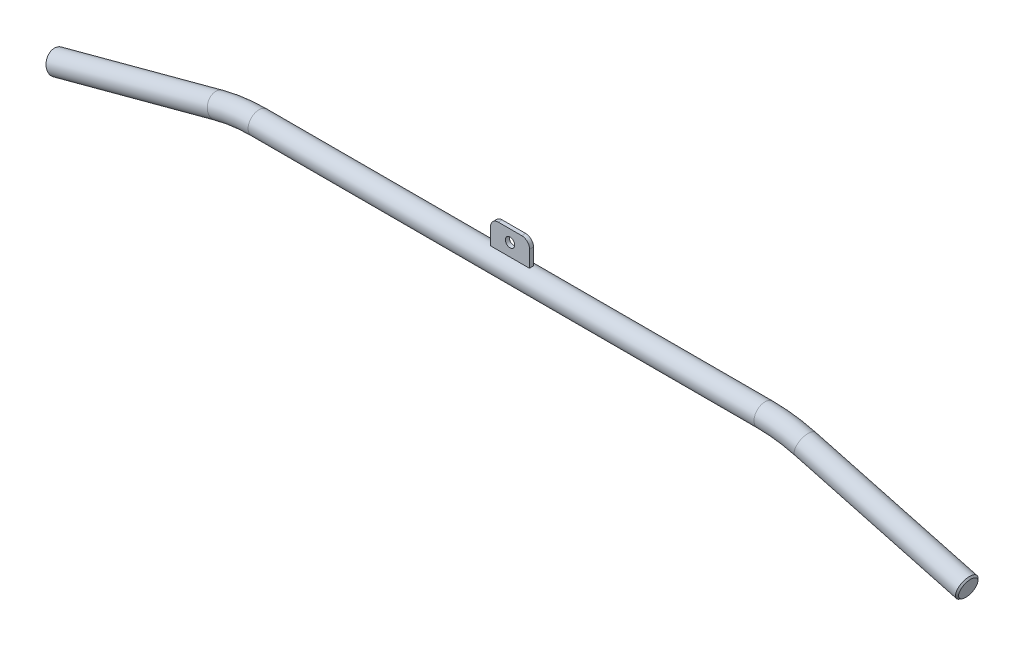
ISO-10303-21;
HEADER;
FILE_DESCRIPTION(('STEP AP214'),'2;1');
FILE_NAME('part.step','',(''),(''),'','','');
FILE_SCHEMA(('AUTOMOTIVE_DESIGN { 1 0 10303 214 1 1 1 1 }'));
ENDSEC;
DATA;
#1=APPLICATION_CONTEXT('core data for automotive mechanical design processes');
#2=APPLICATION_PROTOCOL_DEFINITION('international standard','automotive_design',2000,#1);
#3=PRODUCT_CONTEXT('',#1,'mechanical');
#4=PRODUCT('Part','Part','',(#3));
#5=PRODUCT_RELATED_PRODUCT_CATEGORY('part','',(#4));
#6=PRODUCT_DEFINITION_FORMATION('','',#4);
#7=PRODUCT_DEFINITION_CONTEXT('part definition',#1,'design');
#8=PRODUCT_DEFINITION('design','',#6,#7);
#9=PRODUCT_DEFINITION_SHAPE('','',#8);
#10=(LENGTH_UNIT() NAMED_UNIT(*) SI_UNIT(.MILLI.,.METRE.));
#11=(NAMED_UNIT(*) PLANE_ANGLE_UNIT() SI_UNIT($,.RADIAN.));
#12=(NAMED_UNIT(*) SI_UNIT($,.STERADIAN.) SOLID_ANGLE_UNIT());
#13=UNCERTAINTY_MEASURE_WITH_UNIT(LENGTH_MEASURE(1.E-05),#10,'distance_accuracy_value','');
#14=(GEOMETRIC_REPRESENTATION_CONTEXT(3) GLOBAL_UNCERTAINTY_ASSIGNED_CONTEXT((#13)) GLOBAL_UNIT_ASSIGNED_CONTEXT((#10,
#11,#12)) REPRESENTATION_CONTEXT('',''));
#15=CARTESIAN_POINT('',(0.,0.,0.));
#16=DIRECTION('',(0.,0.,1.));
#17=DIRECTION('',(1.,0.,0.));
#18=AXIS2_PLACEMENT_3D('',#15,#16,#17);
#19=CARTESIAN_POINT('',(-323.669500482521,0.,0.));
#20=DIRECTION('',(1.,0.,0.));
#21=DIRECTION('',(0.,1.,0.));
#22=AXIS2_PLACEMENT_3D('',#19,#20,#21);
#23=CYLINDRICAL_SURFACE('',#22,14.);
#24=CARTESIAN_POINT('',(323.66950048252,0.,0.));
#25=DIRECTION('',(-1.,0.,0.));
#26=DIRECTION('',(0.,-1.,0.));
#27=AXIS2_PLACEMENT_3D('',#24,#25,#26);
#28=CIRCLE('',#27,14.);
#29=CARTESIAN_POINT('',(323.66950048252,14.,0.));
#30=VERTEX_POINT('',#29);
#31=EDGE_CURVE('E136',#30,#30,#28,.T.);
#32=ORIENTED_EDGE('',*,*,#31,.T.);
#33=EDGE_LOOP('',(#32));
#34=FACE_BOUND('',#33,.T.);
#35=CARTESIAN_POINT('',(-323.669500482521,0.,0.));
#36=DIRECTION('',(-1.,0.,0.));
#37=DIRECTION('',(0.,-1.,0.));
#38=AXIS2_PLACEMENT_3D('',#35,#36,#37);
#39=CIRCLE('',#38,14.);
#40=CARTESIAN_POINT('',(-323.669500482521,14.,0.));
#41=VERTEX_POINT('',#40);
#42=EDGE_CURVE('E133',#41,#41,#39,.T.);
#43=ORIENTED_EDGE('',*,*,#42,.F.);
#44=EDGE_LOOP('',(#43));
#45=FACE_BOUND('',#44,.T.);
#46=DIRECTION('',(1.,0.,0.));
#47=VECTOR('',#46,1.);
#48=CARTESIAN_POINT('',(-323.669500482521,13.7749773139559,-2.5));
#49=LINE('',#48,#47);
#50=CARTESIAN_POINT('',(25.,13.7749773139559,-2.5));
#51=VERTEX_POINT('',#50);
#52=CARTESIAN_POINT('',(-25.,13.7749773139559,-2.5));
#53=VERTEX_POINT('',#52);
#54=EDGE_CURVE('E11',#51,#53,#49,.F.);
#55=ORIENTED_EDGE('',*,*,#54,.F.);
#56=CARTESIAN_POINT('',(25.,0.,0.));
#57=DIRECTION('',(1.,0.,0.));
#58=DIRECTION('',(0.,1.,0.));
#59=AXIS2_PLACEMENT_3D('',#56,#57,#58);
#60=CIRCLE('',#59,14.);
#61=CARTESIAN_POINT('',(25.,13.7749773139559,2.5));
#62=VERTEX_POINT('',#61);
#63=EDGE_CURVE('E54',#51,#62,#60,.T.);
#64=ORIENTED_EDGE('',*,*,#63,.T.);
#65=DIRECTION('',(1.,0.,0.));
#66=VECTOR('',#65,1.);
#67=CARTESIAN_POINT('',(-323.669500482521,13.7749773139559,2.5));
#68=LINE('',#67,#66);
#69=CARTESIAN_POINT('',(-25.,13.7749773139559,2.5));
#70=VERTEX_POINT('',#69);
#71=EDGE_CURVE('E91',#62,#70,#68,.F.);
#72=ORIENTED_EDGE('',*,*,#71,.T.);
#73=CARTESIAN_POINT('',(-25.,0.,0.));
#74=DIRECTION('',(-1.,0.,0.));
#75=DIRECTION('',(0.,-1.,0.));
#76=AXIS2_PLACEMENT_3D('',#73,#74,#75);
#77=CIRCLE('',#76,14.);
#78=EDGE_CURVE('E39',#70,#53,#77,.T.);
#79=ORIENTED_EDGE('',*,*,#78,.T.);
#80=EDGE_LOOP('',(#55,#64,#72,#79));
#81=FACE_BOUND('',#80,.T.);
#82=ADVANCED_FACE('F31',(#34,#45,#81),#23,.T.);
#83=CARTESIAN_POINT('',(375.433309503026,-6.81483474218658,0.));
#84=DIRECTION('',(0.965925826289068,-0.258819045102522,0.));
#85=DIRECTION('',(0.258819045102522,0.965925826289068,0.));
#86=AXIS2_PLACEMENT_3D('',#83,#84,#85);
#87=CYLINDRICAL_SURFACE('',#86,14.);
#88=CARTESIAN_POINT('',(581.822198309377,-62.1165708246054,0.));
#89=DIRECTION('',(-0.965925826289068,0.258819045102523,0.));
#90=DIRECTION('',(-0.258819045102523,-0.965925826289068,0.));
#91=AXIS2_PLACEMENT_3D('',#88,#89,#90);
#92=CIRCLE('',#91,14.);
#93=CARTESIAN_POINT('',(578.198731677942,-75.6395323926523,0.));
#94=VERTEX_POINT('',#93);
#95=EDGE_CURVE('E142',#94,#94,#92,.T.);
#96=ORIENTED_EDGE('',*,*,#95,.T.);
#97=EDGE_LOOP('',(#96));
#98=FACE_BOUND('',#97,.T.);
#99=CARTESIAN_POINT('',(375.433309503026,-6.81483474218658,0.));
#100=DIRECTION('',(-0.965925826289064,0.258819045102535,0.));
#101=DIRECTION('',(-0.258819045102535,-0.965925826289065,0.));
#102=AXIS2_PLACEMENT_3D('',#99,#100,#101);
#103=CIRCLE('',#102,14.);
#104=CARTESIAN_POINT('',(379.056776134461,6.70812682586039,0.));
#105=VERTEX_POINT('',#104);
#106=EDGE_CURVE('E139',#105,#105,#103,.T.);
#107=ORIENTED_EDGE('',*,*,#106,.F.);
#108=EDGE_LOOP('',(#107));
#109=FACE_BOUND('',#108,.T.);
#110=ADVANCED_FACE('F180',(#98,#109),#87,.T.);
#111=CARTESIAN_POINT('',(323.669500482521,-200.,0.));
#112=DIRECTION('',(0.,0.,-1.));
#113=DIRECTION('',(-1.,0.,0.));
#114=AXIS2_PLACEMENT_3D('',#111,#112,#113);
#115=TOROIDAL_SURFACE('',#114,200.,14.);
#116=CARTESIAN_POINT('',(323.669500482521,-200.,0.));
#117=DIRECTION('',(0.,0.,-1.));
#118=DIRECTION('',(-1.,0.,0.));
#119=AXIS2_PLACEMENT_3D('',#116,#117,#118);
#120=CIRCLE('',#119,214.);
#121=EDGE_CURVE('',#30,#105,#120,.T.);
#122=ORIENTED_EDGE('',*,*,#31,.F.);
#123=ORIENTED_EDGE('',*,*,#106,.T.);
#124=ORIENTED_EDGE('',*,*,#121,.T.);
#125=ORIENTED_EDGE('',*,*,#121,.F.);
#126=EDGE_LOOP('',(#122,#124,#123,#125));
#127=FACE_BOUND('',#126,.T.);
#128=ADVANCED_FACE('F186',(#127),#115,.T.);
#129=CARTESIAN_POINT('',(-323.669500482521,-200.,0.));
#130=DIRECTION('',(0.,0.,-1.));
#131=DIRECTION('',(-1.,0.,0.));
#132=AXIS2_PLACEMENT_3D('',#129,#130,#131);
#133=TOROIDAL_SURFACE('',#132,200.,14.);
#134=CARTESIAN_POINT('',(-375.433309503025,-6.81483474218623,0.));
#135=DIRECTION('',(-0.96592582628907,-0.258819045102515,0.));
#136=DIRECTION('',(0.258819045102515,-0.96592582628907,0.));
#137=AXIS2_PLACEMENT_3D('',#134,#135,#136);
#138=CIRCLE('',#137,14.);
#139=CARTESIAN_POINT('',(-379.056776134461,6.70812682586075,0.));
#140=VERTEX_POINT('',#139);
#141=EDGE_CURVE('E127',#140,#140,#138,.T.);
#142=CARTESIAN_POINT('',(-323.669500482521,-200.,0.));
#143=DIRECTION('',(0.,0.,-1.));
#144=DIRECTION('',(-1.,0.,0.));
#145=AXIS2_PLACEMENT_3D('',#142,#143,#144);
#146=CIRCLE('',#145,214.);
#147=EDGE_CURVE('',#140,#41,#146,.T.);
#148=ORIENTED_EDGE('',*,*,#141,.F.);
#149=ORIENTED_EDGE('',*,*,#42,.T.);
#150=ORIENTED_EDGE('',*,*,#147,.T.);
#151=ORIENTED_EDGE('',*,*,#147,.F.);
#152=EDGE_LOOP('',(#148,#150,#149,#151));
#153=FACE_BOUND('',#152,.T.);
#154=ADVANCED_FACE('F192',(#153),#133,.T.);
#155=CARTESIAN_POINT('',(-375.433309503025,-6.81483474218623,0.));
#156=DIRECTION('',(-0.96592582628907,-0.258819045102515,0.));
#157=DIRECTION('',(0.258819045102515,-0.96592582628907,0.));
#158=AXIS2_PLACEMENT_3D('',#155,#156,#157);
#159=CYLINDRICAL_SURFACE('',#158,14.);
#160=CARTESIAN_POINT('',(-581.822198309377,-62.1165708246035,0.));
#161=DIRECTION('',(-0.965925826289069,-0.258819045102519,0.));
#162=DIRECTION('',(0.258819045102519,-0.965925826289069,0.));
#163=AXIS2_PLACEMENT_3D('',#160,#161,#162);
#164=CIRCLE('',#163,14.);
#165=CARTESIAN_POINT('',(-585.445664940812,-48.5936092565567,0.));
#166=VERTEX_POINT('',#165);
#167=EDGE_CURVE('E151',#166,#166,#164,.F.);
#168=ORIENTED_EDGE('',*,*,#167,.T.);
#169=EDGE_LOOP('',(#168));
#170=FACE_BOUND('',#169,.T.);
#171=ORIENTED_EDGE('',*,*,#141,.T.);
#172=EDGE_LOOP('',(#171));
#173=FACE_BOUND('',#172,.T.);
#174=ADVANCED_FACE('F216',(#170,#173),#159,.T.);
#175=CARTESIAN_POINT('',(583.754049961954,-62.6342089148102,0.));
#176=DIRECTION('',(-0.965925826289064,0.258819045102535,0.));
#177=DIRECTION('',(-0.258819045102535,-0.965925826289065,0.));
#178=AXIS2_PLACEMENT_3D('',#175,#176,#177);
#179=PLANE('',#178);
#180=CARTESIAN_POINT('',(583.754049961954,-62.6342089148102,0.));
#181=DIRECTION('',(-0.965925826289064,0.258819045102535,0.));
#182=DIRECTION('',(-0.258819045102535,-0.965925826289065,0.));
#183=AXIS2_PLACEMENT_3D('',#180,#181,#182);
#184=CIRCLE('',#183,12.000000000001);
#185=CARTESIAN_POINT('',(580.648221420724,-74.22531883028,0.));
#186=VERTEX_POINT('',#185);
#187=EDGE_CURVE('E145',#186,#186,#184,.F.);
#188=ORIENTED_EDGE('',*,*,#187,.T.);
#189=EDGE_LOOP('',(#188));
#190=FACE_BOUND('',#189,.T.);
#191=ADVANCED_FACE('F205',(#190),#179,.F.);
#192=CARTESIAN_POINT('',(-583.754049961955,-62.6342089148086,0.));
#193=DIRECTION('',(-0.96592582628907,-0.258819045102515,0.));
#194=DIRECTION('',(0.258819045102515,-0.96592582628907,0.));
#195=AXIS2_PLACEMENT_3D('',#192,#193,#194);
#196=PLANE('',#195);
#197=CARTESIAN_POINT('',(-583.754049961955,-62.6342089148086,0.));
#198=DIRECTION('',(-0.96592582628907,-0.258819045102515,0.));
#199=DIRECTION('',(0.258819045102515,-0.96592582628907,0.));
#200=AXIS2_PLACEMENT_3D('',#197,#198,#199);
#201=CIRCLE('',#200,12.0000000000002);
#202=CARTESIAN_POINT('',(-586.859878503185,-51.0430989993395,0.));
#203=VERTEX_POINT('',#202);
#204=EDGE_CURVE('E148',#203,#203,#201,.T.);
#205=ORIENTED_EDGE('',*,*,#204,.T.);
#206=EDGE_LOOP('',(#205));
#207=FACE_BOUND('',#206,.T.);
#208=ADVANCED_FACE('F198',(#207),#196,.T.);
#209=CARTESIAN_POINT('',(581.822198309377,-62.1165708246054,0.));
#210=DIRECTION('',(-0.965925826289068,0.258819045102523,0.));
#211=DIRECTION('',(-0.258819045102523,-0.965925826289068,0.));
#212=AXIS2_PLACEMENT_3D('',#209,#210,#211);
#213=CONICAL_SURFACE('',#212,14.,0.785398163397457);
#214=CARTESIAN_POINT('',(580.648221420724,-74.22531883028,0.));
#215=CARTESIAN_POINT('',(580.62270590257,-74.2400502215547,0.));
#216=CARTESIAN_POINT('',(580.597190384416,-74.2547816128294,0.));
#217=CARTESIAN_POINT('',(580.546159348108,-74.2842443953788,0.));
#218=CARTESIAN_POINT('',(580.520643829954,-74.2989757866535,0.));
#219=CARTESIAN_POINT('',(580.469612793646,-74.328438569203,0.));
#220=CARTESIAN_POINT('',(580.444097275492,-74.3431699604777,0.));
#221=CARTESIAN_POINT('',(580.393066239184,-74.3726327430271,0.));
#222=CARTESIAN_POINT('',(580.36755072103,-74.3873641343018,0.));
#223=CARTESIAN_POINT('',(580.316519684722,-74.4168269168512,0.));
#224=CARTESIAN_POINT('',(580.291004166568,-74.4315583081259,0.));
#225=CARTESIAN_POINT('',(580.23997313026,-74.4610210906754,0.));
#226=CARTESIAN_POINT('',(580.214457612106,-74.4757524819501,0.));
#227=CARTESIAN_POINT('',(580.163426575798,-74.5052152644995,0.));
#228=CARTESIAN_POINT('',(580.137911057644,-74.5199466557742,0.));
#229=CARTESIAN_POINT('',(580.086880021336,-74.5494094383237,0.));
#230=CARTESIAN_POINT('',(580.061364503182,-74.5641408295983,0.));
#231=CARTESIAN_POINT('',(580.010333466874,-74.5936036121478,0.));
#232=CARTESIAN_POINT('',(579.98481794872,-74.6083350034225,0.));
#233=CARTESIAN_POINT('',(579.933786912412,-74.6377977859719,0.));
#234=CARTESIAN_POINT('',(579.908271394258,-74.6525291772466,0.));
#235=CARTESIAN_POINT('',(579.85724035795,-74.6819919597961,0.));
#236=CARTESIAN_POINT('',(579.831724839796,-74.6967233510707,0.));
#237=CARTESIAN_POINT('',(579.780693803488,-74.7261861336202,0.));
#238=CARTESIAN_POINT('',(579.755178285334,-74.7409175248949,0.));
#239=CARTESIAN_POINT('',(579.704147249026,-74.7703803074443,0.));
#240=CARTESIAN_POINT('',(579.678631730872,-74.785111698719,0.));
#241=CARTESIAN_POINT('',(579.627600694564,-74.8145744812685,0.));
#242=CARTESIAN_POINT('',(579.602085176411,-74.8293058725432,0.));
#243=CARTESIAN_POINT('',(579.551054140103,-74.8587686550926,0.));
#244=CARTESIAN_POINT('',(579.525538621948,-74.8735000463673,0.));
#245=CARTESIAN_POINT('',(579.474507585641,-74.9029628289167,0.));
#246=CARTESIAN_POINT('',(579.448992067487,-74.9176942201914,0.));
#247=CARTESIAN_POINT('',(579.397961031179,-74.9471570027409,0.));
#248=CARTESIAN_POINT('',(579.372445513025,-74.9618883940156,0.));
#249=CARTESIAN_POINT('',(579.321414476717,-74.991351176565,0.));
#250=CARTESIAN_POINT('',(579.295898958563,-75.0060825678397,0.));
#251=CARTESIAN_POINT('',(579.244867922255,-75.0355453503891,0.));
#252=CARTESIAN_POINT('',(579.219352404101,-75.0502767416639,0.));
#253=CARTESIAN_POINT('',(579.168321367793,-75.0797395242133,0.));
#254=CARTESIAN_POINT('',(579.142805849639,-75.094470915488,0.));
#255=CARTESIAN_POINT('',(579.091774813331,-75.1239336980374,0.));
#256=CARTESIAN_POINT('',(579.066259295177,-75.1386650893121,0.));
#257=CARTESIAN_POINT('',(579.015228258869,-75.1681278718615,0.));
#258=CARTESIAN_POINT('',(578.989712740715,-75.1828592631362,0.));
#259=CARTESIAN_POINT('',(578.938681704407,-75.2123220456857,0.));
#260=CARTESIAN_POINT('',(578.913166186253,-75.2270534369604,0.));
#261=CARTESIAN_POINT('',(578.862135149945,-75.2565162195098,0.));
#262=CARTESIAN_POINT('',(578.836619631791,-75.2712476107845,0.));
#263=CARTESIAN_POINT('',(578.785588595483,-75.3007103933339,0.));
#264=CARTESIAN_POINT('',(578.760073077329,-75.3154417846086,0.));
#265=CARTESIAN_POINT('',(578.709042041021,-75.3449045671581,0.));
#266=CARTESIAN_POINT('',(578.683526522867,-75.3596359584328,0.));
#267=CARTESIAN_POINT('',(578.632495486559,-75.3890987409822,0.));
#268=CARTESIAN_POINT('',(578.606979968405,-75.4038301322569,0.));
#269=CARTESIAN_POINT('',(578.555948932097,-75.4332929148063,0.));
#270=CARTESIAN_POINT('',(578.530433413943,-75.4480243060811,0.));
#271=CARTESIAN_POINT('',(578.479402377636,-75.4774870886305,0.));
#272=CARTESIAN_POINT('',(578.453886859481,-75.4922184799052,0.));
#273=CARTESIAN_POINT('',(578.402855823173,-75.5216812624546,0.));
#274=CARTESIAN_POINT('',(578.37734030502,-75.5364126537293,0.));
#275=CARTESIAN_POINT('',(578.326309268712,-75.5658754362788,0.));
#276=CARTESIAN_POINT('',(578.300793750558,-75.5806068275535,0.));
#277=CARTESIAN_POINT('',(578.24976271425,-75.6100696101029,0.));
#278=CARTESIAN_POINT('',(578.224247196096,-75.6248010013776,0.));
#279=CARTESIAN_POINT('',(578.198731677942,-75.6395323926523,0.));
#280=B_SPLINE_CURVE_WITH_KNOTS('',3,(#214,#215,#216,#217,#218,#219,#220,#221,#222,#223,#224,
#225,#226,#227,#228,#229,#230,#231,#232,#233,#234,#235,#236,#237,#238,#239,#240,#241,#242,#243,
#244,#245,#246,#247,#248,#249,#250,#251,#252,#253,#254,#255,#256,#257,#258,#259,#260,#261,#262,
#263,#264,#265,#266,#267,#268,#269,#270,#271,#272,#273,#274,#275,#276,#277,#278,#279),
.UNSPECIFIED.,.F.,.F.,(4,2,2,2,2,2,2,2,2,2,2,2,2,2,2,2,2,2,2,2,2,2,2,2,2,2,2,2,2,2,2,2,4),(0.,
0.0883883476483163,0.176776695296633,0.265165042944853,0.353553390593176,0.441941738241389,
0.530330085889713,0.618718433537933,0.707106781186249,0.795495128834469,0.883883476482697,
0.972271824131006,1.06066017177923,1.14904851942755,1.23743686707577,1.32582521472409,
1.41421356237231,1.50260191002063,1.59099025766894,1.67937860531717,1.76776695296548,
1.8561553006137,1.94454364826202,2.03293199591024,2.12132034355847,2.20970869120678,
2.298097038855,2.38648538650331,2.47487373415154,2.56326208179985,2.65165042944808,
2.7400387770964,2.82842712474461),.UNSPECIFIED.);
#281=EDGE_CURVE('BSEAM196',#186,#94,#280,.T.);
#282=ORIENTED_EDGE('',*,*,#187,.F.);
#283=ORIENTED_EDGE('',*,*,#95,.F.);
#284=ORIENTED_EDGE('',*,*,#281,.T.);
#285=ORIENTED_EDGE('',*,*,#281,.F.);
#286=EDGE_LOOP('',(#282,#284,#283,#285));
#287=FACE_BOUND('',#286,.T.);
#288=ADVANCED_FACE('F196',(#287),#213,.T.);
#289=CARTESIAN_POINT('',(-583.754049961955,-62.6342089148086,0.));
#290=DIRECTION('',(0.965925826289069,0.258819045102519,0.));
#291=DIRECTION('',(-0.258819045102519,0.965925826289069,0.));
#292=AXIS2_PLACEMENT_3D('',#289,#290,#291);
#293=CONICAL_SURFACE('',#292,12.0000000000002,0.785398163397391);
#294=CARTESIAN_POINT('',(-585.445664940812,-48.5936092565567,0.));
#295=CARTESIAN_POINT('',(-585.460396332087,-48.6191247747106,0.));
#296=CARTESIAN_POINT('',(-585.475127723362,-48.6446402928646,0.));
#297=CARTESIAN_POINT('',(-585.504590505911,-48.6956713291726,0.));
#298=CARTESIAN_POINT('',(-585.519321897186,-48.7211868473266,0.));
#299=CARTESIAN_POINT('',(-585.548784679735,-48.7722178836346,0.));
#300=CARTESIAN_POINT('',(-585.56351607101,-48.7977334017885,0.));
#301=CARTESIAN_POINT('',(-585.592978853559,-48.8487644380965,0.));
#302=CARTESIAN_POINT('',(-585.607710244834,-48.8742799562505,0.));
#303=CARTESIAN_POINT('',(-585.637173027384,-48.9253109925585,0.));
#304=CARTESIAN_POINT('',(-585.651904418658,-48.9508265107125,0.));
#305=CARTESIAN_POINT('',(-585.681367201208,-49.0018575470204,0.));
#306=CARTESIAN_POINT('',(-585.696098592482,-49.0273730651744,0.));
#307=CARTESIAN_POINT('',(-585.725561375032,-49.0784041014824,0.));
#308=CARTESIAN_POINT('',(-585.740292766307,-49.1039196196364,0.));
#309=CARTESIAN_POINT('',(-585.769755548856,-49.1549506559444,0.));
#310=CARTESIAN_POINT('',(-585.784486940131,-49.1804661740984,0.));
#311=CARTESIAN_POINT('',(-585.81394972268,-49.2314972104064,0.));
#312=CARTESIAN_POINT('',(-585.828681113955,-49.2570127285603,0.));
#313=CARTESIAN_POINT('',(-585.858143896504,-49.3080437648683,0.));
#314=CARTESIAN_POINT('',(-585.872875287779,-49.3335592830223,0.));
#315=CARTESIAN_POINT('',(-585.902338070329,-49.3845903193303,0.));
#316=CARTESIAN_POINT('',(-585.917069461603,-49.4101058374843,0.));
#317=CARTESIAN_POINT('',(-585.946532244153,-49.4611368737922,0.));
#318=CARTESIAN_POINT('',(-585.961263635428,-49.4866523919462,0.));
#319=CARTESIAN_POINT('',(-585.990726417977,-49.5376834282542,0.));
#320=CARTESIAN_POINT('',(-586.005457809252,-49.5631989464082,0.));
#321=CARTESIAN_POINT('',(-586.034920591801,-49.6142299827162,0.));
#322=CARTESIAN_POINT('',(-586.049651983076,-49.6397455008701,0.));
#323=CARTESIAN_POINT('',(-586.079114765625,-49.6907765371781,0.));
#324=CARTESIAN_POINT('',(-586.0938461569,-49.7162920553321,0.));
#325=CARTESIAN_POINT('',(-586.123308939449,-49.7673230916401,0.));
#326=CARTESIAN_POINT('',(-586.138040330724,-49.7928386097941,0.));
#327=CARTESIAN_POINT('',(-586.167503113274,-49.843869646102,0.));
#328=CARTESIAN_POINT('',(-586.182234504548,-49.869385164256,0.));
#329=CARTESIAN_POINT('',(-586.211697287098,-49.920416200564,0.));
#330=CARTESIAN_POINT('',(-586.226428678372,-49.945931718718,0.));
#331=CARTESIAN_POINT('',(-586.255891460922,-49.996962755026,0.));
#332=CARTESIAN_POINT('',(-586.270622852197,-50.02247827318,0.));
#333=CARTESIAN_POINT('',(-586.300085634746,-50.0735093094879,0.));
#334=CARTESIAN_POINT('',(-586.314817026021,-50.0990248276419,0.));
#335=CARTESIAN_POINT('',(-586.34427980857,-50.1500558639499,0.));
#336=CARTESIAN_POINT('',(-586.359011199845,-50.1755713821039,0.));
#337=CARTESIAN_POINT('',(-586.388473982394,-50.2266024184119,0.));
#338=CARTESIAN_POINT('',(-586.403205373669,-50.2521179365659,0.));
#339=CARTESIAN_POINT('',(-586.432668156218,-50.3031489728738,0.));
#340=CARTESIAN_POINT('',(-586.447399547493,-50.3286644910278,0.));
#341=CARTESIAN_POINT('',(-586.476862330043,-50.3796955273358,0.));
#342=CARTESIAN_POINT('',(-586.491593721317,-50.4052110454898,0.));
#343=CARTESIAN_POINT('',(-586.521056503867,-50.4562420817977,0.));
#344=CARTESIAN_POINT('',(-586.535787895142,-50.4817575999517,0.));
#345=CARTESIAN_POINT('',(-586.565250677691,-50.5327886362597,0.));
#346=CARTESIAN_POINT('',(-586.579982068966,-50.5583041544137,0.));
#347=CARTESIAN_POINT('',(-586.609444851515,-50.6093351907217,0.));
#348=CARTESIAN_POINT('',(-586.62417624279,-50.6348507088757,0.));
#349=CARTESIAN_POINT('',(-586.653639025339,-50.6858817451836,0.));
#350=CARTESIAN_POINT('',(-586.668370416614,-50.7113972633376,0.));
#351=CARTESIAN_POINT('',(-586.697833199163,-50.7624282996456,0.));
#352=CARTESIAN_POINT('',(-586.712564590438,-50.7879438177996,0.));
#353=CARTESIAN_POINT('',(-586.742027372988,-50.8389748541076,0.));
#354=CARTESIAN_POINT('',(-586.756758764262,-50.8644903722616,0.));
#355=CARTESIAN_POINT('',(-586.786221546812,-50.9155214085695,0.));
#356=CARTESIAN_POINT('',(-586.800952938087,-50.9410369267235,0.));
#357=CARTESIAN_POINT('',(-586.830415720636,-50.9920679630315,0.));
#358=CARTESIAN_POINT('',(-586.845147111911,-51.0175834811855,0.));
#359=CARTESIAN_POINT('',(-586.859878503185,-51.0430989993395,0.));
#360=B_SPLINE_CURVE_WITH_KNOTS('',3,(#294,#295,#296,#297,#298,#299,#300,#301,#302,#303,#304,
#305,#306,#307,#308,#309,#310,#311,#312,#313,#314,#315,#316,#317,#318,#319,#320,#321,#322,#323,
#324,#325,#326,#327,#328,#329,#330,#331,#332,#333,#334,#335,#336,#337,#338,#339,#340,#341,#342,
#343,#344,#345,#346,#347,#348,#349,#350,#351,#352,#353,#354,#355,#356,#357,#358,#359),
.UNSPECIFIED.,.F.,.F.,(4,2,2,2,2,2,2,2,2,2,2,2,2,2,2,2,2,2,2,2,2,2,2,2,2,2,2,2,2,2,2,2,4),(0.,
0.0883883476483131,0.176776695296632,0.265165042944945,0.353553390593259,0.441941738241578,
0.530330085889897,0.618718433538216,0.707106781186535,0.795495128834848,0.883883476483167,
0.97227182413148,1.06066017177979,1.14904851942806,1.23743686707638,1.32582521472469,
1.414213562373,1.50260191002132,1.59099025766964,1.67937860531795,1.76776695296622,
1.85615530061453,1.94454364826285,2.03293199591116,2.12132034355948,2.2097086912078,
2.29809703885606,2.38648538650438,2.47487373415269,2.56326208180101,2.65165042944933,
2.74003877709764,2.82842712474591),.UNSPECIFIED.);
#361=EDGE_CURVE('BSEAM33',#166,#203,#360,.T.);
#362=ORIENTED_EDGE('',*,*,#167,.F.);
#363=ORIENTED_EDGE('',*,*,#204,.F.);
#364=ORIENTED_EDGE('',*,*,#361,.T.);
#365=ORIENTED_EDGE('',*,*,#361,.F.);
#366=EDGE_LOOP('',(#362,#364,#363,#365));
#367=FACE_BOUND('',#366,.T.);
#368=ADVANCED_FACE('F33',(#367),#293,.T.);
#369=CARTESIAN_POINT('',(-25.,34.9999999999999,-2.5));
#370=DIRECTION('',(-1.,0.,0.));
#371=DIRECTION('',(0.,-1.,0.));
#372=AXIS2_PLACEMENT_3D('',#369,#370,#371);
#373=PLANE('',#372);
#374=ORIENTED_EDGE('',*,*,#78,.F.);
#375=DIRECTION('',(0.,-1.,0.));
#376=VECTOR('',#375,1.);
#377=CARTESIAN_POINT('',(-25.,34.9999999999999,2.5));
#378=LINE('',#377,#376);
#379=CARTESIAN_POINT('',(-25.,34.9999999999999,2.5));
#380=VERTEX_POINT('',#379);
#381=EDGE_CURVE('E46',#380,#70,#378,.T.);
#382=ORIENTED_EDGE('',*,*,#381,.F.);
#383=DIRECTION('',(0.,0.,1.));
#384=VECTOR('',#383,1.);
#385=CARTESIAN_POINT('',(-25.,34.9999999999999,-2.5));
#386=LINE('',#385,#384);
#387=CARTESIAN_POINT('',(-25.,34.9999999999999,-2.5));
#388=VERTEX_POINT('',#387);
#389=EDGE_CURVE('E125',#388,#380,#386,.T.);
#390=ORIENTED_EDGE('',*,*,#389,.F.);
#391=DIRECTION('',(0.,-1.,0.));
#392=VECTOR('',#391,1.);
#393=CARTESIAN_POINT('',(-25.,34.9999999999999,-2.5));
#394=LINE('',#393,#392);
#395=EDGE_CURVE('E114',#388,#53,#394,.T.);
#396=ORIENTED_EDGE('',*,*,#395,.T.);
#397=EDGE_LOOP('',(#374,#382,#390,#396));
#398=FACE_BOUND('',#397,.T.);
#399=ADVANCED_FACE('F159',(#398),#373,.T.);
#400=CARTESIAN_POINT('',(25.,0.,-2.5));
#401=DIRECTION('',(1.,0.,0.));
#402=DIRECTION('',(0.,1.,0.));
#403=AXIS2_PLACEMENT_3D('',#400,#401,#402);
#404=PLANE('',#403);
#405=ORIENTED_EDGE('',*,*,#63,.F.);
#406=DIRECTION('',(0.,1.,0.));
#407=VECTOR('',#406,1.);
#408=CARTESIAN_POINT('',(25.,0.,-2.5));
#409=LINE('',#408,#407);
#410=CARTESIAN_POINT('',(25.,34.9999999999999,-2.5));
#411=VERTEX_POINT('',#410);
#412=EDGE_CURVE('E96',#51,#411,#409,.T.);
#413=ORIENTED_EDGE('',*,*,#412,.T.);
#414=DIRECTION('',(0.,0.,1.));
#415=VECTOR('',#414,1.);
#416=CARTESIAN_POINT('',(25.,34.9999999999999,-2.5));
#417=LINE('',#416,#415);
#418=CARTESIAN_POINT('',(25.,34.9999999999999,2.5));
#419=VERTEX_POINT('',#418);
#420=EDGE_CURVE('E94',#411,#419,#417,.T.);
#421=ORIENTED_EDGE('',*,*,#420,.T.);
#422=DIRECTION('',(0.,1.,0.));
#423=VECTOR('',#422,1.);
#424=CARTESIAN_POINT('',(25.,0.,2.5));
#425=LINE('',#424,#423);
#426=EDGE_CURVE('E83',#62,#419,#425,.T.);
#427=ORIENTED_EDGE('',*,*,#426,.F.);
#428=EDGE_LOOP('',(#405,#413,#421,#427));
#429=FACE_BOUND('',#428,.T.);
#430=ADVANCED_FACE('F95',(#429),#404,.T.);
#431=CARTESIAN_POINT('',(15.,35.,-2.5));
#432=DIRECTION('',(0.,0.,1.));
#433=DIRECTION('',(1.,0.,0.));
#434=AXIS2_PLACEMENT_3D('',#431,#432,#433);
#435=PLANE('',#434);
#436=CARTESIAN_POINT('',(0.,30.,-2.5));
#437=DIRECTION('',(0.,0.,1.));
#438=DIRECTION('',(1.,0.,0.));
#439=AXIS2_PLACEMENT_3D('',#436,#437,#438);
#440=CIRCLE('',#439,6.);
#441=CARTESIAN_POINT('',(6.,30.,-2.5));
#442=VERTEX_POINT('',#441);
#443=EDGE_CURVE('E111',#442,#442,#440,.T.);
#444=ORIENTED_EDGE('',*,*,#443,.T.);
#445=EDGE_LOOP('',(#444));
#446=FACE_BOUND('',#445,.T.);
#447=ORIENTED_EDGE('',*,*,#412,.F.);
#448=ORIENTED_EDGE('',*,*,#54,.T.);
#449=ORIENTED_EDGE('',*,*,#395,.F.);
#450=CARTESIAN_POINT('',(-15.,35.,-2.5));
#451=DIRECTION('',(0.,0.,1.));
#452=DIRECTION('',(1.,0.,0.));
#453=AXIS2_PLACEMENT_3D('',#450,#451,#452);
#454=CIRCLE('',#453,10.);
#455=CARTESIAN_POINT('',(-14.9999999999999,45.,-2.5));
#456=VERTEX_POINT('',#455);
#457=EDGE_CURVE('E101',#456,#388,#454,.T.);
#458=ORIENTED_EDGE('',*,*,#457,.F.);
#459=DIRECTION('',(-1.,0.,0.));
#460=VECTOR('',#459,1.);
#461=CARTESIAN_POINT('',(14.9999999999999,45.,-2.5));
#462=LINE('',#461,#460);
#463=CARTESIAN_POINT('',(14.9999999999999,45.,-2.5));
#464=VERTEX_POINT('',#463);
#465=EDGE_CURVE('E120',#464,#456,#462,.T.);
#466=ORIENTED_EDGE('',*,*,#465,.F.);
#467=CARTESIAN_POINT('',(15.,35.,-2.5));
#468=DIRECTION('',(0.,0.,1.));
#469=DIRECTION('',(1.,0.,0.));
#470=AXIS2_PLACEMENT_3D('',#467,#468,#469);
#471=CIRCLE('',#470,10.);
#472=EDGE_CURVE('E118',#411,#464,#471,.T.);
#473=ORIENTED_EDGE('',*,*,#472,.F.);
#474=EDGE_LOOP('',(#447,#448,#449,#458,#466,#473));
#475=FACE_BOUND('',#474,.T.);
#476=ADVANCED_FACE('F163',(#446,#475),#435,.F.);
#477=CARTESIAN_POINT('',(15.,35.,2.5));
#478=DIRECTION('',(0.,0.,1.));
#479=DIRECTION('',(1.,0.,0.));
#480=AXIS2_PLACEMENT_3D('',#477,#478,#479);
#481=PLANE('',#480);
#482=CARTESIAN_POINT('',(0.,30.,2.5));
#483=DIRECTION('',(0.,0.,1.));
#484=DIRECTION('',(1.,0.,0.));
#485=AXIS2_PLACEMENT_3D('',#482,#483,#484);
#486=CIRCLE('',#485,6.);
#487=CARTESIAN_POINT('',(6.,30.,2.5));
#488=VERTEX_POINT('',#487);
#489=EDGE_CURVE('E245',#488,#488,#486,.T.);
#490=ORIENTED_EDGE('',*,*,#489,.F.);
#491=EDGE_LOOP('',(#490));
#492=FACE_BOUND('',#491,.T.);
#493=ORIENTED_EDGE('',*,*,#71,.F.);
#494=ORIENTED_EDGE('',*,*,#426,.T.);
#495=CARTESIAN_POINT('',(15.,35.,2.5));
#496=DIRECTION('',(0.,0.,1.));
#497=DIRECTION('',(1.,0.,0.));
#498=AXIS2_PLACEMENT_3D('',#495,#496,#497);
#499=CIRCLE('',#498,10.);
#500=CARTESIAN_POINT('',(14.9999999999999,45.,2.5));
#501=VERTEX_POINT('',#500);
#502=EDGE_CURVE('E88',#419,#501,#499,.T.);
#503=ORIENTED_EDGE('',*,*,#502,.T.);
#504=DIRECTION('',(-1.,0.,0.));
#505=VECTOR('',#504,1.);
#506=CARTESIAN_POINT('',(14.9999999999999,45.,2.5));
#507=LINE('',#506,#505);
#508=CARTESIAN_POINT('',(-14.9999999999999,45.,2.5));
#509=VERTEX_POINT('',#508);
#510=EDGE_CURVE('E104',#501,#509,#507,.T.);
#511=ORIENTED_EDGE('',*,*,#510,.T.);
#512=CARTESIAN_POINT('',(-15.,35.,2.5));
#513=DIRECTION('',(0.,0.,1.));
#514=DIRECTION('',(1.,0.,0.));
#515=AXIS2_PLACEMENT_3D('',#512,#513,#514);
#516=CIRCLE('',#515,10.);
#517=EDGE_CURVE('E106',#509,#380,#516,.T.);
#518=ORIENTED_EDGE('',*,*,#517,.T.);
#519=ORIENTED_EDGE('',*,*,#381,.T.);
#520=EDGE_LOOP('',(#493,#494,#503,#511,#518,#519));
#521=FACE_BOUND('',#520,.T.);
#522=ADVANCED_FACE('F85',(#492,#521),#481,.T.);
#523=CARTESIAN_POINT('',(-15.,35.,-2.5));
#524=DIRECTION('',(0.,0.,1.));
#525=DIRECTION('',(1.,0.,0.));
#526=AXIS2_PLACEMENT_3D('',#523,#524,#525);
#527=CYLINDRICAL_SURFACE('',#526,10.);
#528=ORIENTED_EDGE('',*,*,#389,.T.);
#529=ORIENTED_EDGE('',*,*,#517,.F.);
#530=DIRECTION('',(0.,0.,1.));
#531=VECTOR('',#530,1.);
#532=CARTESIAN_POINT('',(-14.9999999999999,45.,-2.5));
#533=LINE('',#532,#531);
#534=EDGE_CURVE('E128',#456,#509,#533,.T.);
#535=ORIENTED_EDGE('',*,*,#534,.F.);
#536=ORIENTED_EDGE('',*,*,#457,.T.);
#537=EDGE_LOOP('',(#528,#529,#535,#536));
#538=FACE_BOUND('',#537,.T.);
#539=ADVANCED_FACE('F166',(#538),#527,.T.);
#540=CARTESIAN_POINT('',(14.9999999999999,45.,-2.5));
#541=DIRECTION('',(0.,1.,0.));
#542=DIRECTION('',(-1.,0.,0.));
#543=AXIS2_PLACEMENT_3D('',#540,#541,#542);
#544=PLANE('',#543);
#545=ORIENTED_EDGE('',*,*,#534,.T.);
#546=ORIENTED_EDGE('',*,*,#510,.F.);
#547=DIRECTION('',(0.,0.,1.));
#548=VECTOR('',#547,1.);
#549=CARTESIAN_POINT('',(14.9999999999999,45.,-2.5));
#550=LINE('',#549,#548);
#551=EDGE_CURVE('E100',#464,#501,#550,.T.);
#552=ORIENTED_EDGE('',*,*,#551,.F.);
#553=ORIENTED_EDGE('',*,*,#465,.T.);
#554=EDGE_LOOP('',(#545,#546,#552,#553));
#555=FACE_BOUND('',#554,.T.);
#556=ADVANCED_FACE('F169',(#555),#544,.T.);
#557=CARTESIAN_POINT('',(15.,35.,-2.5));
#558=DIRECTION('',(0.,0.,1.));
#559=DIRECTION('',(1.,0.,0.));
#560=AXIS2_PLACEMENT_3D('',#557,#558,#559);
#561=CYLINDRICAL_SURFACE('',#560,10.);
#562=ORIENTED_EDGE('',*,*,#551,.T.);
#563=ORIENTED_EDGE('',*,*,#502,.F.);
#564=ORIENTED_EDGE('',*,*,#420,.F.);
#565=ORIENTED_EDGE('',*,*,#472,.T.);
#566=EDGE_LOOP('',(#562,#563,#564,#565));
#567=FACE_BOUND('',#566,.T.);
#568=ADVANCED_FACE('F103',(#567),#561,.T.);
#569=CARTESIAN_POINT('',(0.,30.,-2.5));
#570=DIRECTION('',(0.,0.,1.));
#571=DIRECTION('',(1.,0.,0.));
#572=AXIS2_PLACEMENT_3D('',#569,#570,#571);
#573=CYLINDRICAL_SURFACE('',#572,6.);
#574=ORIENTED_EDGE('',*,*,#443,.F.);
#575=EDGE_LOOP('',(#574));
#576=FACE_BOUND('',#575,.T.);
#577=ORIENTED_EDGE('',*,*,#489,.T.);
#578=EDGE_LOOP('',(#577));
#579=FACE_BOUND('',#578,.T.);
#580=ADVANCED_FACE('F176',(#576,#579),#573,.F.);
#581=CLOSED_SHELL('',(#82,#110,#128,#154,#174,#191,#208,#288,#368,#399,#430,#476,#522,#539,#556,
#568,#580));
#582=MANIFOLD_SOLID_BREP('B2',#581);
#583=ADVANCED_BREP_SHAPE_REPRESENTATION('',(#18,#582),#14);
#584=SHAPE_DEFINITION_REPRESENTATION(#9,#583);
ENDSEC;
END-ISO-10303-21;
